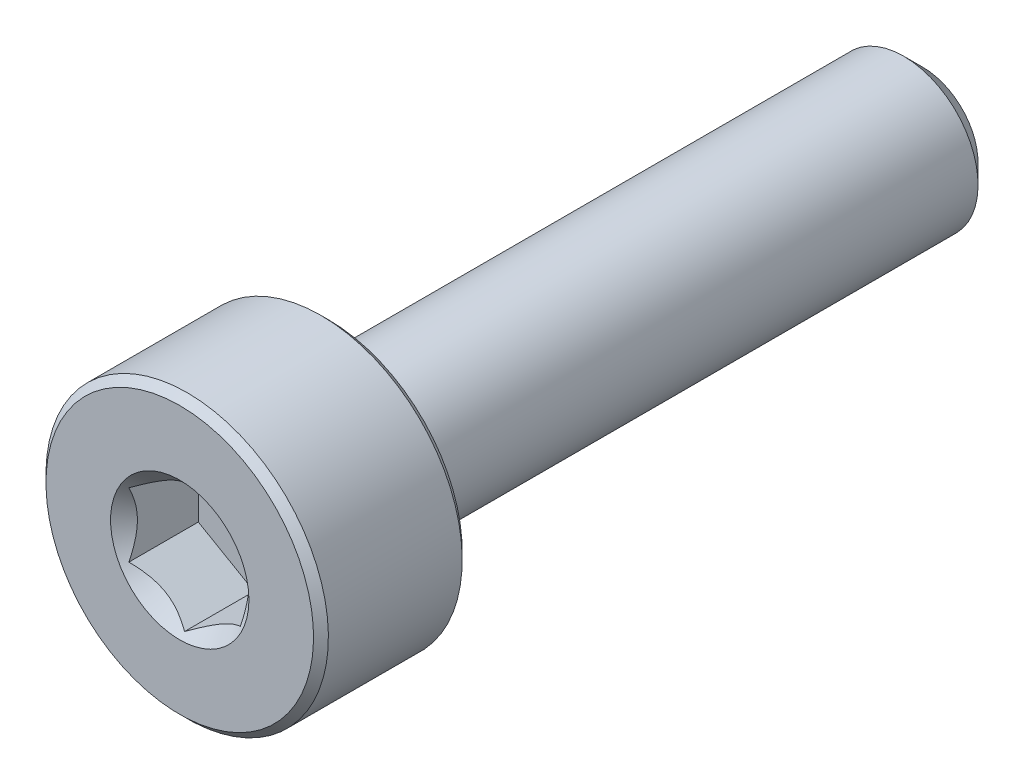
from build123d import *

# Parameters (mm, degrees)
CUT_EXTRUDE1_DEPTH = 1


with BuildPart() as part:
    # Sketch2 → Revolve1 (revolve)
    with BuildSketch(Plane(origin=(0, 0, 0), x_dir=(0, 0, -1), z_dir=(1, 0, 0))):
        with BuildLine():
            Line((-5, 0), (-5, 1.8))
            Line((-5, 1.8), (-4.9, 1.9))
            Line((-4.9, 1.9), (-3.1, 1.9))
            Line((-3.1, 1.9), (-3, 1.8))
            Line((-3, 1.8), (-3, 1.1))
            ThreePointArc((-3, 1.1), (-2.970710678, 1.029289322), (-2.9, 1))
            Line((-2.9, 1), (4.740192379, 1))
            Line((4.740192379, 1), (5, 0.740192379))
            Line((5, 0.740192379), (5, 0))
            Line((5, 0), (-5, 0))
        make_face()
    revolve(axis=Axis((0, 0, -5), (0, 0, 1)))

    # Sketch3 → Cut-Extrude1 (cut)
    with BuildSketch(Plane.XY.offset(5)):
        Polygon((0.75, -0.433012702), (0.75, 0.433012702), (0, 0.866025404), (-0.75, 0.433012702), (-0.75, -0.433012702), (0, -0.866025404), align=None)
    extrude(amount=-CUT_EXTRUDE1_DEPTH, mode=Mode.SUBTRACT)

    # Cut-Extrude2 cone 1 section (on through the dimple's axis) → Cut-Extrude2 (revolve, cut)
    with BuildSketch(Plane(origin=(0, 0, 5), x_dir=(0, -1, 0), z_dir=(1, 0, 0))):
        Polygon((0, 0), (0.930977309, 0), (0, 0.930977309), align=None)
    revolve(axis=Axis((0, 0, 5), (0, 0, -1)), mode=Mode.SUBTRACT)


solid = part.part
